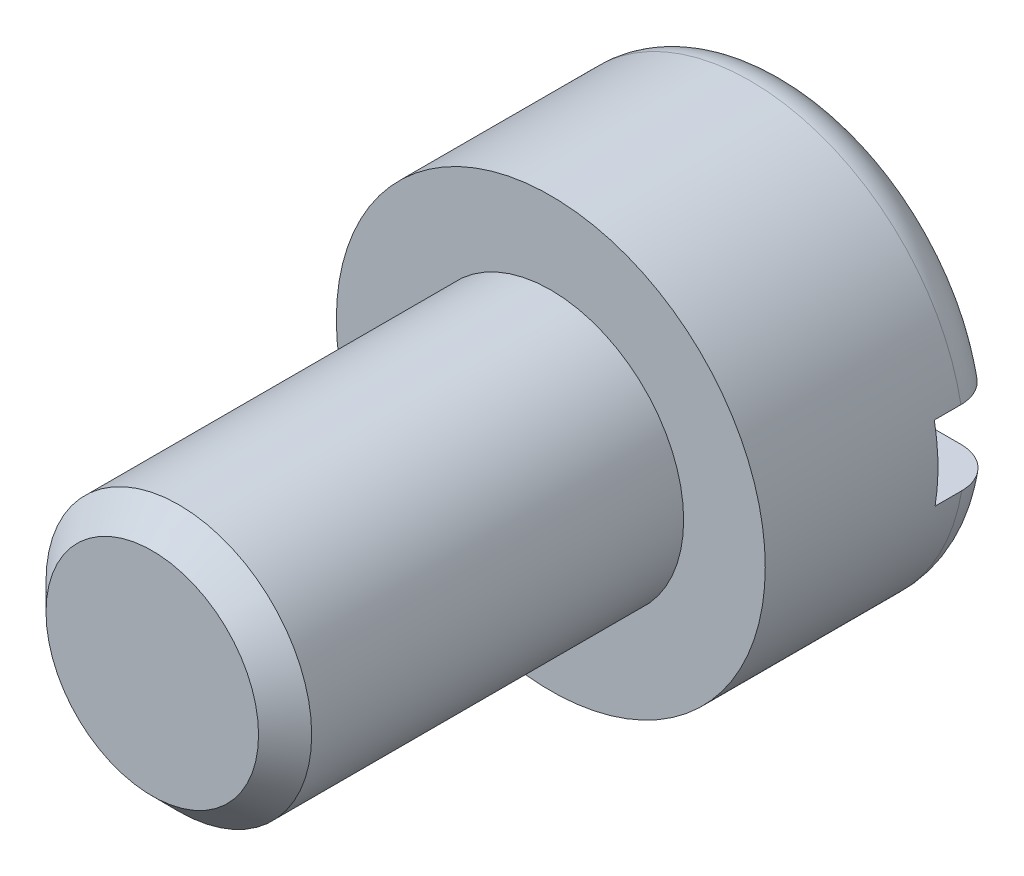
from build123d import *

# Parameters (mm, degrees)
ESQUISSE1_R             = 1
EXTRUSION1_DEPTH        = 3
CHANFREIN1_SIZE         = 0.2
ESQUISSE2_R             = 1.614408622
EXTRUSION2_DEPTH        = 1.8
CONG_1_R                = 0.3
ESQUISSE3_W             = 4.116782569
ESQUISSE3_H             = 0.55842792
ENL_V_MAT_EXTRU_1_DEPTH = 0.5


with BuildPart() as part:
    # Esquisse1 → Extrusion1 (new body)
    with BuildSketch(Plane.XY):
        Circle(ESQUISSE1_R)
    extrude(amount=EXTRUSION1_DEPTH)

    # Chanfrein1
    chanfrein1_edges = [part.edges().sort_by_distance(p)[0] for p in [
        (-1, 0, 3),
    ]]
    chamfer(chanfrein1_edges, length=CHANFREIN1_SIZE)

    # Esquisse2 → Extrusion2 (add)
    with BuildSketch(Plane(origin=(0, 0, 0), x_dir=(-1, 0, 0), z_dir=(0, 0, -1))):
        Circle(ESQUISSE2_R)
    extrude(amount=EXTRUSION2_DEPTH)

    # Cong_1
    cong_1_edges = [part.edges().sort_by_distance(p)[0] for p in [
        (1.614408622, 0, -1.8),
    ]]
    fillet(cong_1_edges, radius=CONG_1_R)

    # Esquisse3 → Enl_v. mat.-Extru.1 (cut)
    with BuildSketch(Plane(origin=(0, 0, -1.8), x_dir=(-1, 0, 0), z_dir=(0, 0, -1))):
        with Locations((-0.042206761, 0.01623337)):
            Rectangle(ESQUISSE3_W, ESQUISSE3_H)
    extrude(amount=-ENL_V_MAT_EXTRU_1_DEPTH, mode=Mode.SUBTRACT)


solid = part.part
